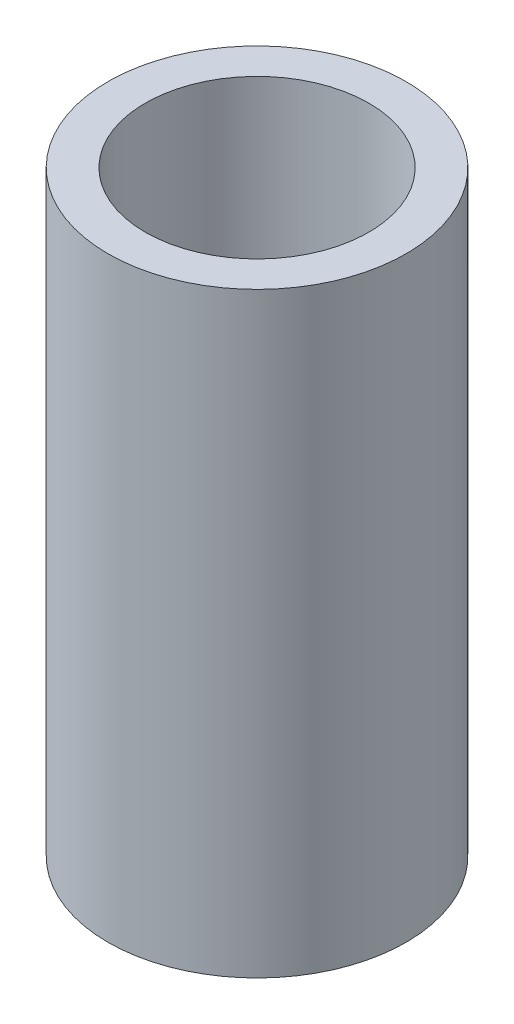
from build123d import *

# Parameters (mm, degrees)
SKETCH1_R           = 4
SKETCH1_R_2         = 3
BOSS_EXTRUDE1_DEPTH = 16


with BuildPart() as part:
    # Sketch1 → Boss-Extrude1 (new body)
    with BuildSketch(Plane(origin=(0, 0, 0), x_dir=(1, 0, 0), z_dir=(0, 1, 0))):
        with Locations(Location((0, 0, 0), (0, 0, 270))):
            Circle(SKETCH1_R)
        with Locations(Location((0, 0, 0), (0, 0, 270))):
            Circle(SKETCH1_R_2, mode=Mode.SUBTRACT)
    extrude(amount=BOSS_EXTRUDE1_DEPTH)


solid = part.part
